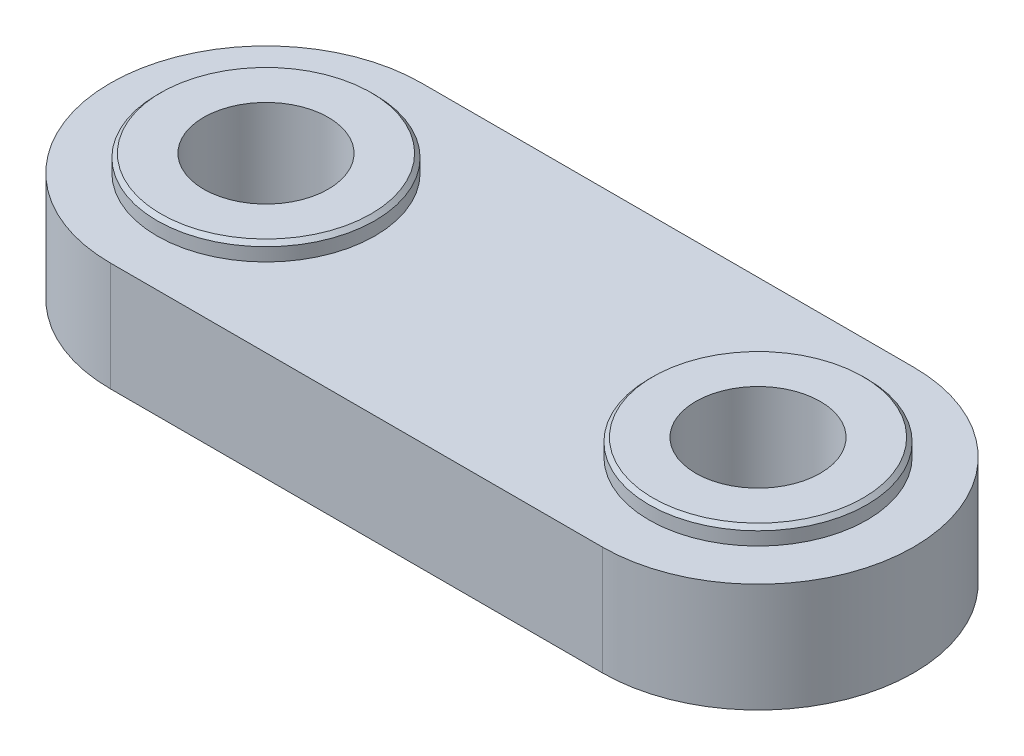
ISO-10303-21;
HEADER;
FILE_DESCRIPTION(('STEP AP214'),'2;1');
FILE_NAME('part.step','',(''),(''),'','','');
FILE_SCHEMA(('AUTOMOTIVE_DESIGN { 1 0 10303 214 1 1 1 1 }'));
ENDSEC;
DATA;
#1=APPLICATION_CONTEXT('core data for automotive mechanical design processes');
#2=APPLICATION_PROTOCOL_DEFINITION('international standard','automotive_design',2000,#1);
#3=PRODUCT_CONTEXT('',#1,'mechanical');
#4=PRODUCT('Part','Part','',(#3));
#5=PRODUCT_RELATED_PRODUCT_CATEGORY('part','',(#4));
#6=PRODUCT_DEFINITION_FORMATION('','',#4);
#7=PRODUCT_DEFINITION_CONTEXT('part definition',#1,'design');
#8=PRODUCT_DEFINITION('design','',#6,#7);
#9=PRODUCT_DEFINITION_SHAPE('','',#8);
#10=(LENGTH_UNIT() NAMED_UNIT(*) SI_UNIT(.MILLI.,.METRE.));
#11=(NAMED_UNIT(*) PLANE_ANGLE_UNIT() SI_UNIT($,.RADIAN.));
#12=(NAMED_UNIT(*) SI_UNIT($,.STERADIAN.) SOLID_ANGLE_UNIT());
#13=UNCERTAINTY_MEASURE_WITH_UNIT(LENGTH_MEASURE(1.E-05),#10,'distance_accuracy_value','');
#14=(GEOMETRIC_REPRESENTATION_CONTEXT(3) GLOBAL_UNCERTAINTY_ASSIGNED_CONTEXT((#13)) GLOBAL_UNIT_ASSIGNED_CONTEXT((#10,
#11,#12)) REPRESENTATION_CONTEXT('',''));
#15=CARTESIAN_POINT('',(0.,0.,0.));
#16=DIRECTION('',(0.,0.,1.));
#17=DIRECTION('',(1.,0.,0.));
#18=AXIS2_PLACEMENT_3D('',#15,#16,#17);
#19=CARTESIAN_POINT('',(0.,-4.6,0.));
#20=DIRECTION('',(0.,1.,0.));
#21=DIRECTION('',(-1.,0.,0.));
#22=AXIS2_PLACEMENT_3D('',#19,#20,#21);
#23=CYLINDRICAL_SURFACE('',#22,4.);
#24=CARTESIAN_POINT('',(0.,-4.6,0.));
#25=DIRECTION('',(0.,-1.,0.));
#26=DIRECTION('',(-1.,0.,0.));
#27=AXIS2_PLACEMENT_3D('',#24,#25,#26);
#28=CIRCLE('',#27,4.);
#29=CARTESIAN_POINT('',(-4.,-4.6,0.));
#30=VERTEX_POINT('',#29);
#31=EDGE_CURVE('E112',#30,#30,#28,.T.);
#32=ORIENTED_EDGE('',*,*,#31,.T.);
#33=EDGE_LOOP('',(#32));
#34=FACE_BOUND('',#33,.T.);
#35=CARTESIAN_POINT('',(0.,4.6,0.));
#36=DIRECTION('',(0.,1.,0.));
#37=DIRECTION('',(1.,0.,0.));
#38=AXIS2_PLACEMENT_3D('',#35,#36,#37);
#39=CIRCLE('',#38,4.);
#40=CARTESIAN_POINT('',(4.,4.6,0.));
#41=VERTEX_POINT('',#40);
#42=EDGE_CURVE('E202',#41,#41,#39,.T.);
#43=ORIENTED_EDGE('',*,*,#42,.T.);
#44=EDGE_LOOP('',(#43));
#45=FACE_BOUND('',#44,.T.);
#46=ADVANCED_FACE('F14',(#34,#45),#23,.F.);
#47=CARTESIAN_POINT('',(31.6,-4.6,0.));
#48=DIRECTION('',(0.,1.,0.));
#49=DIRECTION('',(-1.,0.,0.));
#50=AXIS2_PLACEMENT_3D('',#47,#48,#49);
#51=CYLINDRICAL_SURFACE('',#50,4.);
#52=CARTESIAN_POINT('',(31.6,-4.6,0.));
#53=DIRECTION('',(0.,-1.,0.));
#54=DIRECTION('',(-1.,0.,0.));
#55=AXIS2_PLACEMENT_3D('',#52,#53,#54);
#56=CIRCLE('',#55,4.);
#57=CARTESIAN_POINT('',(27.6,-4.6,0.));
#58=VERTEX_POINT('',#57);
#59=EDGE_CURVE('E205',#58,#58,#56,.T.);
#60=ORIENTED_EDGE('',*,*,#59,.T.);
#61=EDGE_LOOP('',(#60));
#62=FACE_BOUND('',#61,.T.);
#63=CARTESIAN_POINT('',(31.6,4.6,0.));
#64=DIRECTION('',(0.,1.,0.));
#65=DIRECTION('',(1.,0.,0.));
#66=AXIS2_PLACEMENT_3D('',#63,#64,#65);
#67=CIRCLE('',#66,4.);
#68=CARTESIAN_POINT('',(35.6,4.6,0.));
#69=VERTEX_POINT('',#68);
#70=EDGE_CURVE('E200',#69,#69,#67,.T.);
#71=ORIENTED_EDGE('',*,*,#70,.T.);
#72=EDGE_LOOP('',(#71));
#73=FACE_BOUND('',#72,.T.);
#74=ADVANCED_FACE('F149',(#62,#73),#51,.F.);
#75=CARTESIAN_POINT('',(0.,0.,0.));
#76=DIRECTION('',(0.,-1.,0.));
#77=DIRECTION('',(-1.,0.,0.));
#78=AXIS2_PLACEMENT_3D('',#75,#76,#77);
#79=CYLINDRICAL_SURFACE('',#78,10.);
#80=CARTESIAN_POINT('',(0.,-3.5,0.));
#81=DIRECTION('',(0.,1.,0.));
#82=DIRECTION('',(1.,0.,0.));
#83=AXIS2_PLACEMENT_3D('',#80,#81,#82);
#84=CIRCLE('',#83,10.);
#85=CARTESIAN_POINT('',(0.,-3.5,-10.));
#86=VERTEX_POINT('',#85);
#87=CARTESIAN_POINT('',(0.,-3.5,10.));
#88=VERTEX_POINT('',#87);
#89=EDGE_CURVE('E59',#86,#88,#84,.T.);
#90=ORIENTED_EDGE('',*,*,#89,.T.);
#91=DIRECTION('',(0.,-1.,0.));
#92=VECTOR('',#91,1.);
#93=CARTESIAN_POINT('',(0.,0.,10.));
#94=LINE('',#93,#92);
#95=CARTESIAN_POINT('',(0.,3.5,10.));
#96=VERTEX_POINT('',#95);
#97=EDGE_CURVE('E65',#96,#88,#94,.T.);
#98=ORIENTED_EDGE('',*,*,#97,.F.);
#99=CARTESIAN_POINT('',(0.,3.5,0.));
#100=DIRECTION('',(0.,1.,0.));
#101=DIRECTION('',(1.,0.,0.));
#102=AXIS2_PLACEMENT_3D('',#99,#100,#101);
#103=CIRCLE('',#102,10.);
#104=CARTESIAN_POINT('',(0.,3.5,-10.));
#105=VERTEX_POINT('',#104);
#106=EDGE_CURVE('E99',#105,#96,#103,.T.);
#107=ORIENTED_EDGE('',*,*,#106,.F.);
#108=DIRECTION('',(0.,-1.,0.));
#109=VECTOR('',#108,1.);
#110=CARTESIAN_POINT('',(0.,0.,-10.));
#111=LINE('',#110,#109);
#112=EDGE_CURVE('E67',#105,#86,#111,.T.);
#113=ORIENTED_EDGE('',*,*,#112,.T.);
#114=EDGE_LOOP('',(#90,#98,#107,#113));
#115=FACE_BOUND('',#114,.T.);
#116=ADVANCED_FACE('F63',(#115),#79,.T.);
#117=CARTESIAN_POINT('',(0.,0.,10.));
#118=DIRECTION('',(0.,0.,-1.));
#119=DIRECTION('',(0.,1.,0.));
#120=AXIS2_PLACEMENT_3D('',#117,#118,#119);
#121=PLANE('',#120);
#122=DIRECTION('',(1.,0.,0.));
#123=VECTOR('',#122,1.);
#124=CARTESIAN_POINT('',(0.,-3.5,10.));
#125=LINE('',#124,#123);
#126=CARTESIAN_POINT('',(31.6,-3.5,10.));
#127=VERTEX_POINT('',#126);
#128=EDGE_CURVE('E70',#88,#127,#125,.T.);
#129=ORIENTED_EDGE('',*,*,#128,.T.);
#130=DIRECTION('',(0.,-1.,0.));
#131=VECTOR('',#130,1.);
#132=CARTESIAN_POINT('',(31.6,0.,10.));
#133=LINE('',#132,#131);
#134=CARTESIAN_POINT('',(31.6,3.5,10.));
#135=VERTEX_POINT('',#134);
#136=EDGE_CURVE('E47',#135,#127,#133,.T.);
#137=ORIENTED_EDGE('',*,*,#136,.F.);
#138=DIRECTION('',(1.,0.,0.));
#139=VECTOR('',#138,1.);
#140=CARTESIAN_POINT('',(0.,3.5,10.));
#141=LINE('',#140,#139);
#142=EDGE_CURVE('E74',#96,#135,#141,.T.);
#143=ORIENTED_EDGE('',*,*,#142,.F.);
#144=ORIENTED_EDGE('',*,*,#97,.T.);
#145=EDGE_LOOP('',(#129,#137,#143,#144));
#146=FACE_BOUND('',#145,.T.);
#147=ADVANCED_FACE('F73',(#146),#121,.F.);
#148=CARTESIAN_POINT('',(31.6,0.,0.));
#149=DIRECTION('',(0.,-1.,0.));
#150=DIRECTION('',(-1.,0.,0.));
#151=AXIS2_PLACEMENT_3D('',#148,#149,#150);
#152=CYLINDRICAL_SURFACE('',#151,10.);
#153=CARTESIAN_POINT('',(31.6,-3.5,0.));
#154=DIRECTION('',(0.,1.,0.));
#155=DIRECTION('',(-1.,0.,0.));
#156=AXIS2_PLACEMENT_3D('',#153,#154,#155);
#157=CIRCLE('',#156,10.);
#158=CARTESIAN_POINT('',(31.6,-3.5,-10.));
#159=VERTEX_POINT('',#158);
#160=EDGE_CURVE('E31',#127,#159,#157,.T.);
#161=ORIENTED_EDGE('',*,*,#160,.T.);
#162=DIRECTION('',(0.,-1.,0.));
#163=VECTOR('',#162,1.);
#164=CARTESIAN_POINT('',(31.6,0.,-10.));
#165=LINE('',#164,#163);
#166=CARTESIAN_POINT('',(31.6,3.5,-10.));
#167=VERTEX_POINT('',#166);
#168=EDGE_CURVE('E51',#167,#159,#165,.T.);
#169=ORIENTED_EDGE('',*,*,#168,.F.);
#170=CARTESIAN_POINT('',(31.6,3.5,0.));
#171=DIRECTION('',(0.,1.,0.));
#172=DIRECTION('',(-1.,0.,0.));
#173=AXIS2_PLACEMENT_3D('',#170,#171,#172);
#174=CIRCLE('',#173,10.);
#175=EDGE_CURVE('E88',#135,#167,#174,.T.);
#176=ORIENTED_EDGE('',*,*,#175,.F.);
#177=ORIENTED_EDGE('',*,*,#136,.T.);
#178=EDGE_LOOP('',(#161,#169,#176,#177));
#179=FACE_BOUND('',#178,.T.);
#180=ADVANCED_FACE('F224',(#179),#152,.T.);
#181=CARTESIAN_POINT('',(31.6,0.,-10.));
#182=DIRECTION('',(0.,0.,1.));
#183=DIRECTION('',(0.,-1.,0.));
#184=AXIS2_PLACEMENT_3D('',#181,#182,#183);
#185=PLANE('',#184);
#186=DIRECTION('',(-1.,0.,0.));
#187=VECTOR('',#186,1.);
#188=CARTESIAN_POINT('',(31.6,-3.5,-10.));
#189=LINE('',#188,#187);
#190=EDGE_CURVE('E71',#159,#86,#189,.T.);
#191=ORIENTED_EDGE('',*,*,#190,.T.);
#192=ORIENTED_EDGE('',*,*,#112,.F.);
#193=DIRECTION('',(-1.,0.,0.));
#194=VECTOR('',#193,1.);
#195=CARTESIAN_POINT('',(31.6,3.5,-10.));
#196=LINE('',#195,#194);
#197=EDGE_CURVE('E101',#167,#105,#196,.T.);
#198=ORIENTED_EDGE('',*,*,#197,.F.);
#199=ORIENTED_EDGE('',*,*,#168,.T.);
#200=EDGE_LOOP('',(#191,#192,#198,#199));
#201=FACE_BOUND('',#200,.T.);
#202=ADVANCED_FACE('F222',(#201),#185,.F.);
#203=CARTESIAN_POINT('',(0.,-3.5,0.));
#204=DIRECTION('',(0.,1.,0.));
#205=DIRECTION('',(1.,0.,0.));
#206=AXIS2_PLACEMENT_3D('',#203,#204,#205);
#207=PLANE('',#206);
#208=CARTESIAN_POINT('',(31.6,-3.5,0.));
#209=DIRECTION('',(0.,1.,0.));
#210=DIRECTION('',(1.,0.,0.));
#211=AXIS2_PLACEMENT_3D('',#208,#209,#210);
#212=CIRCLE('',#211,7.3);
#213=CARTESIAN_POINT('',(38.9,-3.5,0.));
#214=VERTEX_POINT('',#213);
#215=EDGE_CURVE('E92',#214,#214,#212,.F.);
#216=ORIENTED_EDGE('',*,*,#215,.F.);
#217=EDGE_LOOP('',(#216));
#218=FACE_BOUND('',#217,.T.);
#219=ORIENTED_EDGE('',*,*,#190,.F.);
#220=ORIENTED_EDGE('',*,*,#160,.F.);
#221=ORIENTED_EDGE('',*,*,#128,.F.);
#222=ORIENTED_EDGE('',*,*,#89,.F.);
#223=EDGE_LOOP('',(#219,#220,#221,#222));
#224=FACE_BOUND('',#223,.T.);
#225=CARTESIAN_POINT('',(0.,-3.5,0.));
#226=DIRECTION('',(0.,1.,0.));
#227=DIRECTION('',(1.,0.,0.));
#228=AXIS2_PLACEMENT_3D('',#225,#226,#227);
#229=CIRCLE('',#228,7.3);
#230=CARTESIAN_POINT('',(7.3,-3.5,0.));
#231=VERTEX_POINT('',#230);
#232=EDGE_CURVE('E95',#231,#231,#229,.F.);
#233=ORIENTED_EDGE('',*,*,#232,.F.);
#234=EDGE_LOOP('',(#233));
#235=FACE_BOUND('',#234,.T.);
#236=ADVANCED_FACE('F76',(#218,#224,#235),#207,.F.);
#237=CARTESIAN_POINT('',(31.6,-3.5,0.));
#238=DIRECTION('',(0.,-1.,0.));
#239=DIRECTION('',(1.,0.,0.));
#240=AXIS2_PLACEMENT_3D('',#237,#238,#239);
#241=CYLINDRICAL_SURFACE('',#240,7.5);
#242=CARTESIAN_POINT('',(31.6,-4.35,0.));
#243=DIRECTION('',(0.,-1.,0.));
#244=DIRECTION('',(-1.,0.,0.));
#245=AXIS2_PLACEMENT_3D('',#242,#243,#244);
#246=CIRCLE('',#245,7.5);
#247=CARTESIAN_POINT('',(24.1,-4.35,0.));
#248=VERTEX_POINT('',#247);
#249=EDGE_CURVE('E129',#248,#248,#246,.F.);
#250=ORIENTED_EDGE('',*,*,#249,.T.);
#251=EDGE_LOOP('',(#250));
#252=FACE_BOUND('',#251,.T.);
#253=CARTESIAN_POINT('',(31.6,-3.7,0.));
#254=DIRECTION('',(0.,-1.,0.));
#255=DIRECTION('',(1.,0.,0.));
#256=AXIS2_PLACEMENT_3D('',#253,#254,#255);
#257=CIRCLE('',#256,7.5);
#258=CARTESIAN_POINT('',(39.1,-3.7,0.));
#259=VERTEX_POINT('',#258);
#260=EDGE_CURVE('E109',#259,#259,#257,.T.);
#261=ORIENTED_EDGE('',*,*,#260,.T.);
#262=EDGE_LOOP('',(#261));
#263=FACE_BOUND('',#262,.T.);
#264=ADVANCED_FACE('F173',(#252,#263),#241,.T.);
#265=CARTESIAN_POINT('',(31.6,-3.5,0.));
#266=DIRECTION('',(0.,-1.,0.));
#267=DIRECTION('',(1.,0.,0.));
#268=AXIS2_PLACEMENT_3D('',#265,#266,#267);
#269=CONICAL_SURFACE('',#268,7.3,0.785398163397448);
#270=ORIENTED_EDGE('',*,*,#260,.F.);
#271=EDGE_LOOP('',(#270));
#272=FACE_BOUND('',#271,.T.);
#273=ORIENTED_EDGE('',*,*,#215,.T.);
#274=EDGE_LOOP('',(#273));
#275=FACE_BOUND('',#274,.T.);
#276=ADVANCED_FACE('F158',(#272,#275),#269,.T.);
#277=CARTESIAN_POINT('',(0.,-3.5,0.));
#278=DIRECTION('',(0.,-1.,0.));
#279=DIRECTION('',(1.,0.,0.));
#280=AXIS2_PLACEMENT_3D('',#277,#278,#279);
#281=CYLINDRICAL_SURFACE('',#280,7.5);
#282=CARTESIAN_POINT('',(0.,-4.35,0.));
#283=DIRECTION('',(0.,-1.,0.));
#284=DIRECTION('',(-1.,0.,0.));
#285=AXIS2_PLACEMENT_3D('',#282,#283,#284);
#286=CIRCLE('',#285,7.5);
#287=CARTESIAN_POINT('',(-7.5,-4.35,0.));
#288=VERTEX_POINT('',#287);
#289=EDGE_CURVE('E9',#288,#288,#286,.F.);
#290=ORIENTED_EDGE('',*,*,#289,.T.);
#291=EDGE_LOOP('',(#290));
#292=FACE_BOUND('',#291,.T.);
#293=CARTESIAN_POINT('',(0.,-3.7,0.));
#294=DIRECTION('',(0.,-1.,0.));
#295=DIRECTION('',(1.,0.,0.));
#296=AXIS2_PLACEMENT_3D('',#293,#294,#295);
#297=CIRCLE('',#296,7.5);
#298=CARTESIAN_POINT('',(7.5,-3.7,0.));
#299=VERTEX_POINT('',#298);
#300=EDGE_CURVE('E106',#299,#299,#297,.T.);
#301=ORIENTED_EDGE('',*,*,#300,.T.);
#302=EDGE_LOOP('',(#301));
#303=FACE_BOUND('',#302,.T.);
#304=ADVANCED_FACE('F164',(#292,#303),#281,.T.);
#305=CARTESIAN_POINT('',(0.,-3.5,0.));
#306=DIRECTION('',(0.,-1.,0.));
#307=DIRECTION('',(1.,0.,0.));
#308=AXIS2_PLACEMENT_3D('',#305,#306,#307);
#309=CONICAL_SURFACE('',#308,7.3,0.785398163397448);
#310=ORIENTED_EDGE('',*,*,#300,.F.);
#311=EDGE_LOOP('',(#310));
#312=FACE_BOUND('',#311,.T.);
#313=ORIENTED_EDGE('',*,*,#232,.T.);
#314=EDGE_LOOP('',(#313));
#315=FACE_BOUND('',#314,.T.);
#316=ADVANCED_FACE('F167',(#312,#315),#309,.T.);
#317=CARTESIAN_POINT('',(0.,3.5,0.));
#318=DIRECTION('',(0.,1.,0.));
#319=DIRECTION('',(1.,0.,0.));
#320=AXIS2_PLACEMENT_3D('',#317,#318,#319);
#321=PLANE('',#320);
#322=CARTESIAN_POINT('',(31.6,3.5,0.));
#323=DIRECTION('',(0.,1.,0.));
#324=DIRECTION('',(1.,0.,0.));
#325=AXIS2_PLACEMENT_3D('',#322,#323,#324);
#326=CIRCLE('',#325,7.);
#327=CARTESIAN_POINT('',(38.6,3.5,0.));
#328=VERTEX_POINT('',#327);
#329=EDGE_CURVE('E117',#328,#328,#326,.T.);
#330=ORIENTED_EDGE('',*,*,#329,.F.);
#331=EDGE_LOOP('',(#330));
#332=FACE_BOUND('',#331,.T.);
#333=CARTESIAN_POINT('',(0.,3.5,0.));
#334=DIRECTION('',(0.,1.,0.));
#335=DIRECTION('',(1.,0.,0.));
#336=AXIS2_PLACEMENT_3D('',#333,#334,#335);
#337=CIRCLE('',#336,7.);
#338=CARTESIAN_POINT('',(7.,3.5,0.));
#339=VERTEX_POINT('',#338);
#340=EDGE_CURVE('E98',#339,#339,#337,.T.);
#341=ORIENTED_EDGE('',*,*,#340,.F.);
#342=EDGE_LOOP('',(#341));
#343=FACE_BOUND('',#342,.T.);
#344=ORIENTED_EDGE('',*,*,#197,.T.);
#345=ORIENTED_EDGE('',*,*,#106,.T.);
#346=ORIENTED_EDGE('',*,*,#142,.T.);
#347=ORIENTED_EDGE('',*,*,#175,.T.);
#348=EDGE_LOOP('',(#344,#345,#346,#347));
#349=FACE_BOUND('',#348,.T.);
#350=ADVANCED_FACE('F169',(#332,#343,#349),#321,.T.);
#351=CARTESIAN_POINT('',(0.,-4.6,0.));
#352=DIRECTION('',(0.,1.,0.));
#353=DIRECTION('',(-1.,0.,0.));
#354=AXIS2_PLACEMENT_3D('',#351,#352,#353);
#355=CYLINDRICAL_SURFACE('',#354,7.);
#356=CARTESIAN_POINT('',(0.,4.35,0.));
#357=DIRECTION('',(0.,1.,0.));
#358=DIRECTION('',(1.,0.,0.));
#359=AXIS2_PLACEMENT_3D('',#356,#357,#358);
#360=CIRCLE('',#359,7.);
#361=CARTESIAN_POINT('',(7.,4.35,0.));
#362=VERTEX_POINT('',#361);
#363=EDGE_CURVE('E116',#362,#362,#360,.F.);
#364=ORIENTED_EDGE('',*,*,#363,.T.);
#365=EDGE_LOOP('',(#364));
#366=FACE_BOUND('',#365,.T.);
#367=ORIENTED_EDGE('',*,*,#340,.T.);
#368=EDGE_LOOP('',(#367));
#369=FACE_BOUND('',#368,.T.);
#370=ADVANCED_FACE('F163',(#366,#369),#355,.T.);
#371=CARTESIAN_POINT('',(31.6,-4.6,0.));
#372=DIRECTION('',(0.,1.,0.));
#373=DIRECTION('',(-1.,0.,0.));
#374=AXIS2_PLACEMENT_3D('',#371,#372,#373);
#375=CYLINDRICAL_SURFACE('',#374,7.);
#376=CARTESIAN_POINT('',(31.6,4.35,0.));
#377=DIRECTION('',(0.,1.,0.));
#378=DIRECTION('',(1.,0.,0.));
#379=AXIS2_PLACEMENT_3D('',#376,#377,#378);
#380=CIRCLE('',#379,7.);
#381=CARTESIAN_POINT('',(38.6,4.35,0.));
#382=VERTEX_POINT('',#381);
#383=EDGE_CURVE('E123',#382,#382,#380,.F.);
#384=ORIENTED_EDGE('',*,*,#383,.T.);
#385=EDGE_LOOP('',(#384));
#386=FACE_BOUND('',#385,.T.);
#387=ORIENTED_EDGE('',*,*,#329,.T.);
#388=EDGE_LOOP('',(#387));
#389=FACE_BOUND('',#388,.T.);
#390=ADVANCED_FACE('F237',(#386,#389),#375,.T.);
#391=CARTESIAN_POINT('',(0.,-4.6,0.));
#392=DIRECTION('',(0.,-1.,0.));
#393=DIRECTION('',(-1.,0.,0.));
#394=AXIS2_PLACEMENT_3D('',#391,#392,#393);
#395=PLANE('',#394);
#396=CARTESIAN_POINT('',(0.,-4.6,0.));
#397=DIRECTION('',(0.,-1.,0.));
#398=DIRECTION('',(-1.,0.,0.));
#399=AXIS2_PLACEMENT_3D('',#396,#397,#398);
#400=CIRCLE('',#399,7.25);
#401=CARTESIAN_POINT('',(-7.25,-4.6,0.));
#402=VERTEX_POINT('',#401);
#403=EDGE_CURVE('E23',#402,#402,#400,.T.);
#404=ORIENTED_EDGE('',*,*,#403,.T.);
#405=EDGE_LOOP('',(#404));
#406=FACE_BOUND('',#405,.T.);
#407=ORIENTED_EDGE('',*,*,#31,.F.);
#408=EDGE_LOOP('',(#407));
#409=FACE_BOUND('',#408,.T.);
#410=ADVANCED_FACE('F134',(#406,#409),#395,.T.);
#411=CARTESIAN_POINT('',(31.6,-4.6,0.));
#412=DIRECTION('',(0.,-1.,0.));
#413=DIRECTION('',(-1.,0.,0.));
#414=AXIS2_PLACEMENT_3D('',#411,#412,#413);
#415=PLANE('',#414);
#416=CARTESIAN_POINT('',(31.6,-4.6,0.));
#417=DIRECTION('',(0.,-1.,0.));
#418=DIRECTION('',(-1.,0.,0.));
#419=AXIS2_PLACEMENT_3D('',#416,#417,#418);
#420=CIRCLE('',#419,7.25);
#421=CARTESIAN_POINT('',(24.35,-4.6,0.));
#422=VERTEX_POINT('',#421);
#423=EDGE_CURVE('E126',#422,#422,#420,.T.);
#424=ORIENTED_EDGE('',*,*,#423,.T.);
#425=EDGE_LOOP('',(#424));
#426=FACE_BOUND('',#425,.T.);
#427=ORIENTED_EDGE('',*,*,#59,.F.);
#428=EDGE_LOOP('',(#427));
#429=FACE_BOUND('',#428,.T.);
#430=ADVANCED_FACE('F245',(#426,#429),#415,.T.);
#431=CARTESIAN_POINT('',(0.,4.6,0.));
#432=DIRECTION('',(0.,1.,0.));
#433=DIRECTION('',(1.,0.,0.));
#434=AXIS2_PLACEMENT_3D('',#431,#432,#433);
#435=PLANE('',#434);
#436=CARTESIAN_POINT('',(0.,4.6,0.));
#437=DIRECTION('',(0.,1.,0.));
#438=DIRECTION('',(1.,0.,0.));
#439=AXIS2_PLACEMENT_3D('',#436,#437,#438);
#440=CIRCLE('',#439,6.75);
#441=CARTESIAN_POINT('',(6.75,4.6,0.));
#442=VERTEX_POINT('',#441);
#443=EDGE_CURVE('E113',#442,#442,#440,.T.);
#444=ORIENTED_EDGE('',*,*,#443,.T.);
#445=EDGE_LOOP('',(#444));
#446=FACE_BOUND('',#445,.T.);
#447=ORIENTED_EDGE('',*,*,#42,.F.);
#448=EDGE_LOOP('',(#447));
#449=FACE_BOUND('',#448,.T.);
#450=ADVANCED_FACE('F196',(#446,#449),#435,.T.);
#451=CARTESIAN_POINT('',(31.6,4.6,0.));
#452=DIRECTION('',(0.,1.,0.));
#453=DIRECTION('',(1.,0.,0.));
#454=AXIS2_PLACEMENT_3D('',#451,#452,#453);
#455=PLANE('',#454);
#456=CARTESIAN_POINT('',(31.6,4.6,0.));
#457=DIRECTION('',(0.,1.,0.));
#458=DIRECTION('',(1.,0.,0.));
#459=AXIS2_PLACEMENT_3D('',#456,#457,#458);
#460=CIRCLE('',#459,6.75);
#461=CARTESIAN_POINT('',(38.35,4.6,0.));
#462=VERTEX_POINT('',#461);
#463=EDGE_CURVE('E120',#462,#462,#460,.T.);
#464=ORIENTED_EDGE('',*,*,#463,.T.);
#465=EDGE_LOOP('',(#464));
#466=FACE_BOUND('',#465,.T.);
#467=ORIENTED_EDGE('',*,*,#70,.F.);
#468=EDGE_LOOP('',(#467));
#469=FACE_BOUND('',#468,.T.);
#470=ADVANCED_FACE('F183',(#466,#469),#455,.T.);
#471=CARTESIAN_POINT('',(0.,4.6,0.));
#472=DIRECTION('',(0.,-1.,0.));
#473=DIRECTION('',(-1.,0.,0.));
#474=AXIS2_PLACEMENT_3D('',#471,#472,#473);
#475=CONICAL_SURFACE('',#474,6.75,0.785398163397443);
#476=ORIENTED_EDGE('',*,*,#363,.F.);
#477=EDGE_LOOP('',(#476));
#478=FACE_BOUND('',#477,.T.);
#479=ORIENTED_EDGE('',*,*,#443,.F.);
#480=EDGE_LOOP('',(#479));
#481=FACE_BOUND('',#480,.T.);
#482=ADVANCED_FACE('F180',(#478,#481),#475,.T.);
#483=CARTESIAN_POINT('',(31.6,4.6,0.));
#484=DIRECTION('',(0.,-1.,0.));
#485=DIRECTION('',(-1.,0.,0.));
#486=AXIS2_PLACEMENT_3D('',#483,#484,#485);
#487=CONICAL_SURFACE('',#486,6.75,0.785398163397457);
#488=ORIENTED_EDGE('',*,*,#383,.F.);
#489=EDGE_LOOP('',(#488));
#490=FACE_BOUND('',#489,.T.);
#491=ORIENTED_EDGE('',*,*,#463,.F.);
#492=EDGE_LOOP('',(#491));
#493=FACE_BOUND('',#492,.T.);
#494=ADVANCED_FACE('F145',(#490,#493),#487,.T.);
#495=CARTESIAN_POINT('',(31.6,-4.6,0.));
#496=DIRECTION('',(0.,1.,0.));
#497=DIRECTION('',(1.,0.,0.));
#498=AXIS2_PLACEMENT_3D('',#495,#496,#497);
#499=CONICAL_SURFACE('',#498,7.25,0.785398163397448);
#500=ORIENTED_EDGE('',*,*,#249,.F.);
#501=EDGE_LOOP('',(#500));
#502=FACE_BOUND('',#501,.T.);
#503=ORIENTED_EDGE('',*,*,#423,.F.);
#504=EDGE_LOOP('',(#503));
#505=FACE_BOUND('',#504,.T.);
#506=ADVANCED_FACE('F138',(#502,#505),#499,.T.);
#507=CARTESIAN_POINT('',(0.,-4.6,0.));
#508=DIRECTION('',(0.,1.,0.));
#509=DIRECTION('',(1.,0.,0.));
#510=AXIS2_PLACEMENT_3D('',#507,#508,#509);
#511=CONICAL_SURFACE('',#510,7.25,0.785398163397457);
#512=ORIENTED_EDGE('',*,*,#289,.F.);
#513=EDGE_LOOP('',(#512));
#514=FACE_BOUND('',#513,.T.);
#515=ORIENTED_EDGE('',*,*,#403,.F.);
#516=EDGE_LOOP('',(#515));
#517=FACE_BOUND('',#516,.T.);
#518=ADVANCED_FACE('F16',(#514,#517),#511,.T.);
#519=CLOSED_SHELL('',(#46,#74,#116,#147,#180,#202,#236,#264,#276,#304,#316,#350,#370,#390,#410,
#430,#450,#470,#482,#494,#506,#518));
#520=MANIFOLD_SOLID_BREP('B1',#519);
#521=ADVANCED_BREP_SHAPE_REPRESENTATION('',(#18,#520),#14);
#522=SHAPE_DEFINITION_REPRESENTATION(#9,#521);
ENDSEC;
END-ISO-10303-21;
